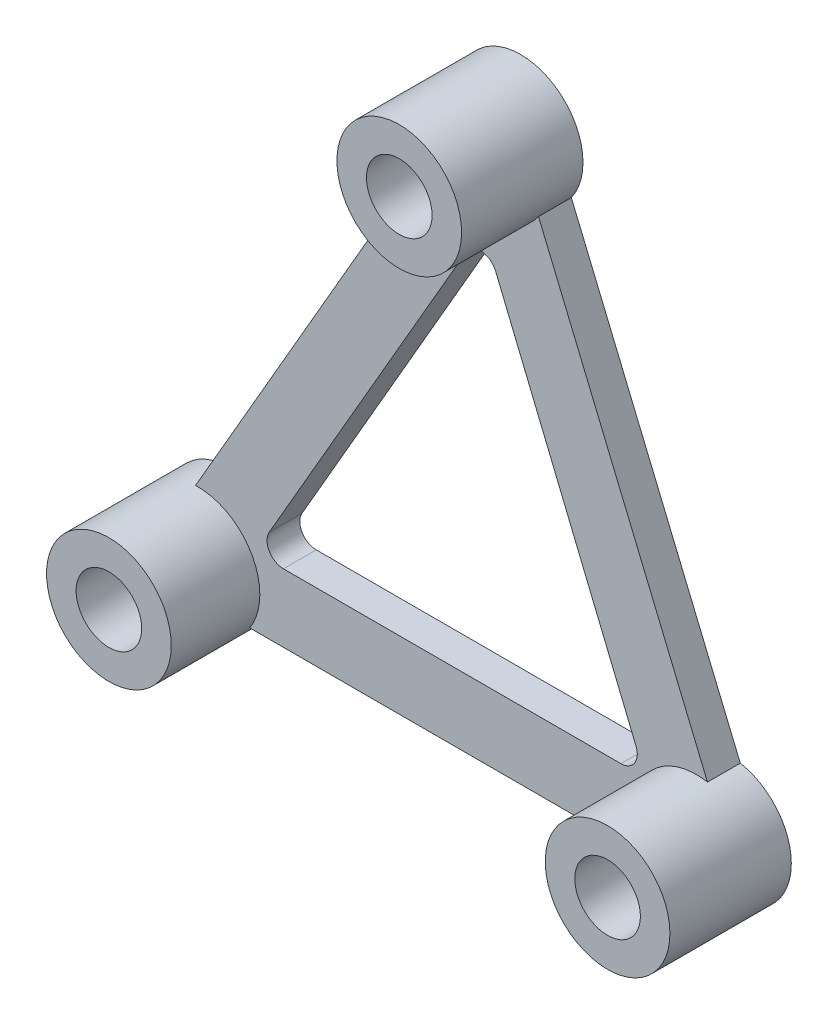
ISO-10303-21;
HEADER;
FILE_DESCRIPTION(('STEP AP214'),'2;1');
FILE_NAME('part.step','',(''),(''),'','','');
FILE_SCHEMA(('AUTOMOTIVE_DESIGN { 1 0 10303 214 1 1 1 1 }'));
ENDSEC;
DATA;
#1=APPLICATION_CONTEXT('core data for automotive mechanical design processes');
#2=APPLICATION_PROTOCOL_DEFINITION('international standard','automotive_design',2000,#1);
#3=PRODUCT_CONTEXT('',#1,'mechanical');
#4=PRODUCT('Part','Part','',(#3));
#5=PRODUCT_RELATED_PRODUCT_CATEGORY('part','',(#4));
#6=PRODUCT_DEFINITION_FORMATION('','',#4);
#7=PRODUCT_DEFINITION_CONTEXT('part definition',#1,'design');
#8=PRODUCT_DEFINITION('design','',#6,#7);
#9=PRODUCT_DEFINITION_SHAPE('','',#8);
#10=(LENGTH_UNIT() NAMED_UNIT(*) SI_UNIT(.MILLI.,.METRE.));
#11=(NAMED_UNIT(*) PLANE_ANGLE_UNIT() SI_UNIT($,.RADIAN.));
#12=(NAMED_UNIT(*) SI_UNIT($,.STERADIAN.) SOLID_ANGLE_UNIT());
#13=UNCERTAINTY_MEASURE_WITH_UNIT(LENGTH_MEASURE(1.E-05),#10,'distance_accuracy_value','');
#14=(GEOMETRIC_REPRESENTATION_CONTEXT(3) GLOBAL_UNCERTAINTY_ASSIGNED_CONTEXT((#13)) GLOBAL_UNIT_ASSIGNED_CONTEXT((#10,
#11,#12)) REPRESENTATION_CONTEXT('',''));
#15=CARTESIAN_POINT('',(0.,0.,0.));
#16=DIRECTION('',(0.,0.,1.));
#17=DIRECTION('',(1.,0.,0.));
#18=AXIS2_PLACEMENT_3D('',#15,#16,#17);
#19=CARTESIAN_POINT('',(17.6999999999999,30.6572992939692,2.));
#20=DIRECTION('',(0.,0.,1.));
#21=DIRECTION('',(1.,0.,0.));
#22=AXIS2_PLACEMENT_3D('',#19,#20,#21);
#23=PLANE('',#22);
#24=CARTESIAN_POINT('',(17.6999999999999,30.6572992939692,2.));
#25=DIRECTION('',(0.,0.,1.));
#26=DIRECTION('',(1.,0.,0.));
#27=AXIS2_PLACEMENT_3D('',#24,#25,#26);
#28=CIRCLE('',#27,3.79999999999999);
#29=CARTESIAN_POINT('',(14.3523997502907,28.8590855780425,2.));
#30=VERTEX_POINT('',#29);
#31=CARTESIAN_POINT('',(20.78925745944,28.4444982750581,2.));
#32=VERTEX_POINT('',#31);
#33=EDGE_CURVE('E50',#30,#32,#28,.T.);
#34=ORIENTED_EDGE('',*,*,#33,.F.);
#35=DIRECTION('',(-0.499999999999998,-0.86602540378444,0.));
#36=VECTOR('',#35,1.);
#37=CARTESIAN_POINT('',(15.967949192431,31.6572992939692,2.));
#38=LINE('',#37,#36);
#39=CARTESIAN_POINT('',(-0.11650136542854,3.79821371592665,2.));
#40=VERTEX_POINT('',#39);
#41=EDGE_CURVE('E199',#30,#40,#38,.T.);
#42=ORIENTED_EDGE('',*,*,#41,.T.);
#43=CARTESIAN_POINT('',(0.,0.,2.));
#44=DIRECTION('',(0.,0.,1.));
#45=DIRECTION('',(1.,0.,0.));
#46=AXIS2_PLACEMENT_3D('',#43,#44,#45);
#47=CIRCLE('',#46,3.8);
#48=CARTESIAN_POINT('',(3.18424228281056,-2.07378906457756,2.));
#49=VERTEX_POINT('',#48);
#50=EDGE_CURVE('E169',#49,#40,#47,.T.);
#51=ORIENTED_EDGE('',*,*,#50,.F.);
#52=DIRECTION('',(1.,0.,0.));
#53=VECTOR('',#52,1.);
#54=CARTESIAN_POINT('',(30.4,-2.07378906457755,2.));
#55=LINE('',#54,#53);
#56=CARTESIAN_POINT('',(27.2157577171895,-2.07378906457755,2.));
#57=VERTEX_POINT('',#56);
#58=EDGE_CURVE('E201',#49,#57,#55,.T.);
#59=ORIENTED_EDGE('',*,*,#58,.T.);
#60=CARTESIAN_POINT('',(30.4,0.,2.));
#61=DIRECTION('',(0.,0.,1.));
#62=DIRECTION('',(1.,0.,0.));
#63=AXIS2_PLACEMENT_3D('',#60,#61,#62);
#64=CIRCLE('',#63,3.79999999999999);
#65=CARTESIAN_POINT('',(31.0889279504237,3.73702800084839,2.));
#66=VERTEX_POINT('',#65);
#67=EDGE_CURVE('E147',#66,#57,#64,.T.);
#68=ORIENTED_EDGE('',*,*,#67,.F.);
#69=DIRECTION('',(-0.384771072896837,0.923012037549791,0.));
#70=VECTOR('',#69,1.);
#71=CARTESIAN_POINT('',(32.3141322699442,0.797934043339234,2.));
#72=LINE('',#71,#70);
#73=EDGE_CURVE('E140',#66,#32,#72,.T.);
#74=ORIENTED_EDGE('',*,*,#73,.T.);
#75=EDGE_LOOP('',(#34,#42,#51,#59,#68,#74));
#76=FACE_BOUND('',#75,.T.);
#77=DIRECTION('',(-0.380662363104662,0.924714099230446,0.));
#78=VECTOR('',#77,1.);
#79=CARTESIAN_POINT('',(27.3036889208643,2.07378906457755,2.));
#80=LINE('',#79,#78);
#81=CARTESIAN_POINT('',(26.7353335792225,3.45445142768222,2.));
#82=VERTEX_POINT('',#81);
#83=CARTESIAN_POINT('',(18.1726891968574,24.2550315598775,2.));
#84=VERTEX_POINT('',#83);
#85=EDGE_CURVE('E182',#82,#84,#80,.T.);
#86=ORIENTED_EDGE('',*,*,#85,.F.);
#87=CARTESIAN_POINT('',(25.810619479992,3.07378906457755,2.));
#88=DIRECTION('',(0.,0.,1.));
#89=DIRECTION('',(1.,0.,0.));
#90=AXIS2_PLACEMENT_3D('',#87,#88,#89);
#91=CIRCLE('',#90,1.);
#92=CARTESIAN_POINT('',(25.810619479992,2.07378906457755,2.));
#93=VERTEX_POINT('',#92);
#94=EDGE_CURVE('E224',#82,#93,#91,.F.);
#95=ORIENTED_EDGE('',*,*,#94,.T.);
#96=DIRECTION('',(1.,0.,0.));
#97=VECTOR('',#96,1.);
#98=CARTESIAN_POINT('',(27.3036889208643,2.07378906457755,2.));
#99=LINE('',#98,#97);
#100=CARTESIAN_POINT('',(5.23875455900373,2.07378906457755,2.));
#101=VERTEX_POINT('',#100);
#102=EDGE_CURVE('E179',#101,#93,#99,.T.);
#103=ORIENTED_EDGE('',*,*,#102,.F.);
#104=CARTESIAN_POINT('',(5.23875455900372,3.07378906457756,2.));
#105=DIRECTION('',(0.,0.,1.));
#106=DIRECTION('',(1.,0.,0.));
#107=AXIS2_PLACEMENT_3D('',#104,#105,#106);
#108=CIRCLE('',#107,1.);
#109=CARTESIAN_POINT('',(4.37272915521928,3.57378906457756,2.));
#110=VERTEX_POINT('',#109);
#111=EDGE_CURVE('E228',#101,#110,#108,.F.);
#112=ORIENTED_EDGE('',*,*,#111,.T.);
#113=DIRECTION('',(-0.499999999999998,-0.86602540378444,0.));
#114=VECTOR('',#113,1.);
#115=CARTESIAN_POINT('',(17.3986500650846,26.1353458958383,2.));
#116=LINE('',#115,#114);
#117=CARTESIAN_POINT('',(16.3819496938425,24.3743691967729,2.));
#118=VERTEX_POINT('',#117);
#119=EDGE_CURVE('E186',#118,#110,#116,.T.);
#120=ORIENTED_EDGE('',*,*,#119,.F.);
#121=CARTESIAN_POINT('',(17.247975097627,23.8743691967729,2.));
#122=DIRECTION('',(0.,0.,1.));
#123=DIRECTION('',(1.,0.,0.));
#124=AXIS2_PLACEMENT_3D('',#121,#122,#123);
#125=CIRCLE('',#124,1.);
#126=EDGE_CURVE('E232',#118,#84,#125,.F.);
#127=ORIENTED_EDGE('',*,*,#126,.T.);
#128=EDGE_LOOP('',(#86,#95,#103,#112,#120,#127));
#129=FACE_BOUND('',#128,.T.);
#130=ADVANCED_FACE('F35',(#76,#129),#23,.T.);
#131=CARTESIAN_POINT('',(17.6999999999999,30.6572992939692,0.));
#132=DIRECTION('',(0.,0.,1.));
#133=DIRECTION('',(1.,0.,0.));
#134=AXIS2_PLACEMENT_3D('',#131,#132,#133);
#135=PLANE('',#134);
#136=DIRECTION('',(-0.499999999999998,-0.86602540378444,0.));
#137=VECTOR('',#136,1.);
#138=CARTESIAN_POINT('',(15.967949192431,31.6572992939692,0.));
#139=LINE('',#138,#137);
#140=CARTESIAN_POINT('',(14.3523997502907,28.8590855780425,0.));
#141=VERTEX_POINT('',#140);
#142=CARTESIAN_POINT('',(-0.11650136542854,3.79821371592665,0.));
#143=VERTEX_POINT('',#142);
#144=EDGE_CURVE('E189',#141,#143,#139,.T.);
#145=ORIENTED_EDGE('',*,*,#144,.F.);
#146=CARTESIAN_POINT('',(17.6999999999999,30.6572992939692,0.));
#147=DIRECTION('',(0.,0.,1.));
#148=DIRECTION('',(1.,0.,0.));
#149=AXIS2_PLACEMENT_3D('',#146,#147,#148);
#150=CIRCLE('',#149,3.79999999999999);
#151=CARTESIAN_POINT('',(20.78925745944,28.4444982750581,0.));
#152=VERTEX_POINT('',#151);
#153=EDGE_CURVE('E131',#152,#141,#150,.T.);
#154=ORIENTED_EDGE('',*,*,#153,.F.);
#155=DIRECTION('',(-0.384771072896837,0.923012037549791,0.));
#156=VECTOR('',#155,1.);
#157=CARTESIAN_POINT('',(32.3141322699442,0.797934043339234,0.));
#158=LINE('',#157,#156);
#159=CARTESIAN_POINT('',(31.0889279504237,3.73702800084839,0.));
#160=VERTEX_POINT('',#159);
#161=EDGE_CURVE('E124',#160,#152,#158,.T.);
#162=ORIENTED_EDGE('',*,*,#161,.F.);
#163=CARTESIAN_POINT('',(30.4,0.,0.));
#164=DIRECTION('',(0.,0.,1.));
#165=DIRECTION('',(1.,0.,0.));
#166=AXIS2_PLACEMENT_3D('',#163,#164,#165);
#167=CIRCLE('',#166,3.79999999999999);
#168=CARTESIAN_POINT('',(27.2157577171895,-2.07378906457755,0.));
#169=VERTEX_POINT('',#168);
#170=EDGE_CURVE('E129',#169,#160,#167,.T.);
#171=ORIENTED_EDGE('',*,*,#170,.F.);
#172=DIRECTION('',(1.,0.,0.));
#173=VECTOR('',#172,1.);
#174=CARTESIAN_POINT('',(30.4,-2.07378906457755,0.));
#175=LINE('',#174,#173);
#176=CARTESIAN_POINT('',(3.18424228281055,-2.07378906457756,0.));
#177=VERTEX_POINT('',#176);
#178=EDGE_CURVE('E135',#177,#169,#175,.T.);
#179=ORIENTED_EDGE('',*,*,#178,.F.);
#180=CARTESIAN_POINT('',(0.,0.,0.));
#181=DIRECTION('',(0.,0.,1.));
#182=DIRECTION('',(1.,0.,0.));
#183=AXIS2_PLACEMENT_3D('',#180,#181,#182);
#184=CIRCLE('',#183,3.8);
#185=EDGE_CURVE('E166',#143,#177,#184,.T.);
#186=ORIENTED_EDGE('',*,*,#185,.F.);
#187=EDGE_LOOP('',(#145,#154,#162,#171,#179,#186));
#188=FACE_BOUND('',#187,.T.);
#189=DIRECTION('',(-0.499999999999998,-0.86602540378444,0.));
#190=VECTOR('',#189,1.);
#191=CARTESIAN_POINT('',(17.3986500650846,26.1353458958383,0.));
#192=LINE('',#191,#190);
#193=CARTESIAN_POINT('',(16.3819496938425,24.3743691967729,0.));
#194=VERTEX_POINT('',#193);
#195=CARTESIAN_POINT('',(4.37272915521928,3.57378906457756,0.));
#196=VERTEX_POINT('',#195);
#197=EDGE_CURVE('E183',#194,#196,#192,.T.);
#198=ORIENTED_EDGE('',*,*,#197,.T.);
#199=CARTESIAN_POINT('',(5.23875455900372,3.07378906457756,0.));
#200=DIRECTION('',(0.,0.,1.));
#201=DIRECTION('',(1.,0.,0.));
#202=AXIS2_PLACEMENT_3D('',#199,#200,#201);
#203=CIRCLE('',#202,1.);
#204=CARTESIAN_POINT('',(5.23875455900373,2.07378906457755,0.));
#205=VERTEX_POINT('',#204);
#206=EDGE_CURVE('E226',#196,#205,#203,.T.);
#207=ORIENTED_EDGE('',*,*,#206,.T.);
#208=DIRECTION('',(1.,0.,0.));
#209=VECTOR('',#208,1.);
#210=CARTESIAN_POINT('',(27.3036889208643,2.07378906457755,0.));
#211=LINE('',#210,#209);
#212=CARTESIAN_POINT('',(25.810619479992,2.07378906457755,0.));
#213=VERTEX_POINT('',#212);
#214=EDGE_CURVE('E178',#205,#213,#211,.T.);
#215=ORIENTED_EDGE('',*,*,#214,.T.);
#216=CARTESIAN_POINT('',(25.810619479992,3.07378906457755,0.));
#217=DIRECTION('',(0.,0.,1.));
#218=DIRECTION('',(1.,0.,0.));
#219=AXIS2_PLACEMENT_3D('',#216,#217,#218);
#220=CIRCLE('',#219,1.);
#221=CARTESIAN_POINT('',(26.7353335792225,3.45445142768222,0.));
#222=VERTEX_POINT('',#221);
#223=EDGE_CURVE('E222',#213,#222,#220,.T.);
#224=ORIENTED_EDGE('',*,*,#223,.T.);
#225=DIRECTION('',(-0.380662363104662,0.924714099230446,0.));
#226=VECTOR('',#225,1.);
#227=CARTESIAN_POINT('',(27.3036889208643,2.07378906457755,0.));
#228=LINE('',#227,#226);
#229=CARTESIAN_POINT('',(18.1726891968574,24.2550315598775,0.));
#230=VERTEX_POINT('',#229);
#231=EDGE_CURVE('E192',#222,#230,#228,.T.);
#232=ORIENTED_EDGE('',*,*,#231,.T.);
#233=CARTESIAN_POINT('',(17.247975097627,23.8743691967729,0.));
#234=DIRECTION('',(0.,0.,1.));
#235=DIRECTION('',(1.,0.,0.));
#236=AXIS2_PLACEMENT_3D('',#233,#234,#235);
#237=CIRCLE('',#236,1.);
#238=EDGE_CURVE('E230',#230,#194,#237,.T.);
#239=ORIENTED_EDGE('',*,*,#238,.T.);
#240=EDGE_LOOP('',(#198,#207,#215,#224,#232,#239));
#241=FACE_BOUND('',#240,.T.);
#242=ADVANCED_FACE('F126',(#188,#241),#135,.F.);
#243=CARTESIAN_POINT('',(15.967949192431,31.6572992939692,2.));
#244=DIRECTION('',(0.86602540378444,-0.499999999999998,0.));
#245=DIRECTION('',(0.499999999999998,0.86602540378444,0.));
#246=AXIS2_PLACEMENT_3D('',#243,#244,#245);
#247=PLANE('',#246);
#248=ORIENTED_EDGE('',*,*,#41,.F.);
#249=DIRECTION('',(0.,0.,1.));
#250=VECTOR('',#249,1.);
#251=CARTESIAN_POINT('',(14.3523997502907,28.8590855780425,0.));
#252=LINE('',#251,#250);
#253=EDGE_CURVE('E57',#30,#141,#252,.F.);
#254=ORIENTED_EDGE('',*,*,#253,.T.);
#255=ORIENTED_EDGE('',*,*,#144,.T.);
#256=DIRECTION('',(0.,0.,1.));
#257=VECTOR('',#256,1.);
#258=CARTESIAN_POINT('',(-0.116501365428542,3.79821371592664,0.));
#259=LINE('',#258,#257);
#260=EDGE_CURVE('E172',#143,#40,#259,.T.);
#261=ORIENTED_EDGE('',*,*,#260,.T.);
#262=EDGE_LOOP('',(#248,#254,#255,#261));
#263=FACE_BOUND('',#262,.T.);
#264=ADVANCED_FACE('F278',(#263),#247,.F.);
#265=CARTESIAN_POINT('',(30.4,-2.07378906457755,2.));
#266=DIRECTION('',(0.,1.,0.));
#267=DIRECTION('',(-1.,0.,0.));
#268=AXIS2_PLACEMENT_3D('',#265,#266,#267);
#269=PLANE('',#268);
#270=ORIENTED_EDGE('',*,*,#178,.T.);
#271=DIRECTION('',(0.,0.,1.));
#272=VECTOR('',#271,1.);
#273=CARTESIAN_POINT('',(27.2157577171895,-2.07378906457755,0.));
#274=LINE('',#273,#272);
#275=EDGE_CURVE('E146',#169,#57,#274,.T.);
#276=ORIENTED_EDGE('',*,*,#275,.T.);
#277=ORIENTED_EDGE('',*,*,#58,.F.);
#278=DIRECTION('',(0.,0.,1.));
#279=VECTOR('',#278,1.);
#280=CARTESIAN_POINT('',(3.18424228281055,-2.07378906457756,0.));
#281=LINE('',#280,#279);
#282=EDGE_CURVE('E143',#49,#177,#281,.F.);
#283=ORIENTED_EDGE('',*,*,#282,.T.);
#284=EDGE_LOOP('',(#270,#276,#277,#283));
#285=FACE_BOUND('',#284,.T.);
#286=ADVANCED_FACE('F238',(#285),#269,.F.);
#287=CARTESIAN_POINT('',(32.3141322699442,0.797934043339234,2.));
#288=DIRECTION('',(-0.923012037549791,-0.384771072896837,0.));
#289=DIRECTION('',(0.384771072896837,-0.923012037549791,0.));
#290=AXIS2_PLACEMENT_3D('',#287,#288,#289);
#291=PLANE('',#290);
#292=ORIENTED_EDGE('',*,*,#161,.T.);
#293=DIRECTION('',(0.,0.,1.));
#294=VECTOR('',#293,1.);
#295=CARTESIAN_POINT('',(20.78925745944,28.4444982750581,0.));
#296=LINE('',#295,#294);
#297=EDGE_CURVE('E11',#152,#32,#296,.T.);
#298=ORIENTED_EDGE('',*,*,#297,.T.);
#299=ORIENTED_EDGE('',*,*,#73,.F.);
#300=DIRECTION('',(0.,0.,1.));
#301=VECTOR('',#300,1.);
#302=CARTESIAN_POINT('',(31.0889279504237,3.73702800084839,0.));
#303=LINE('',#302,#301);
#304=EDGE_CURVE('E43',#66,#160,#303,.F.);
#305=ORIENTED_EDGE('',*,*,#304,.T.);
#306=EDGE_LOOP('',(#292,#298,#299,#305));
#307=FACE_BOUND('',#306,.T.);
#308=ADVANCED_FACE('F139',(#307),#291,.F.);
#309=CARTESIAN_POINT('',(27.3036889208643,2.07378906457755,2.));
#310=DIRECTION('',(0.,1.,0.));
#311=DIRECTION('',(-1.,0.,0.));
#312=AXIS2_PLACEMENT_3D('',#309,#310,#311);
#313=PLANE('',#312);
#314=ORIENTED_EDGE('',*,*,#102,.T.);
#315=DIRECTION('',(0.,0.,-1.));
#316=VECTOR('',#315,1.);
#317=CARTESIAN_POINT('',(25.810619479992,2.07378906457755,0.));
#318=LINE('',#317,#316);
#319=EDGE_CURVE('E209',#93,#213,#318,.T.);
#320=ORIENTED_EDGE('',*,*,#319,.T.);
#321=ORIENTED_EDGE('',*,*,#214,.F.);
#322=DIRECTION('',(0.,0.,-1.));
#323=VECTOR('',#322,1.);
#324=CARTESIAN_POINT('',(5.23875455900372,2.07378906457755,2.));
#325=LINE('',#324,#323);
#326=EDGE_CURVE('E205',#205,#101,#325,.F.);
#327=ORIENTED_EDGE('',*,*,#326,.T.);
#328=EDGE_LOOP('',(#314,#320,#321,#327));
#329=FACE_BOUND('',#328,.T.);
#330=ADVANCED_FACE('F317',(#329),#313,.T.);
#331=CARTESIAN_POINT('',(27.3036889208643,2.07378906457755,2.));
#332=DIRECTION('',(-0.924714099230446,-0.380662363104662,0.));
#333=DIRECTION('',(0.380662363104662,-0.924714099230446,0.));
#334=AXIS2_PLACEMENT_3D('',#331,#332,#333);
#335=PLANE('',#334);
#336=ORIENTED_EDGE('',*,*,#231,.F.);
#337=DIRECTION('',(0.,0.,-1.));
#338=VECTOR('',#337,1.);
#339=CARTESIAN_POINT('',(26.7353335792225,3.45445142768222,2.));
#340=LINE('',#339,#338);
#341=EDGE_CURVE('E215',#222,#82,#340,.F.);
#342=ORIENTED_EDGE('',*,*,#341,.T.);
#343=ORIENTED_EDGE('',*,*,#85,.T.);
#344=DIRECTION('',(0.,0.,-1.));
#345=VECTOR('',#344,1.);
#346=CARTESIAN_POINT('',(18.1726891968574,24.2550315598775,0.));
#347=LINE('',#346,#345);
#348=EDGE_CURVE('E212',#84,#230,#347,.T.);
#349=ORIENTED_EDGE('',*,*,#348,.T.);
#350=EDGE_LOOP('',(#336,#342,#343,#349));
#351=FACE_BOUND('',#350,.T.);
#352=ADVANCED_FACE('F314',(#351),#335,.T.);
#353=CARTESIAN_POINT('',(17.3986500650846,26.1353458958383,2.));
#354=DIRECTION('',(0.86602540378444,-0.499999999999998,0.));
#355=DIRECTION('',(0.499999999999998,0.86602540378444,0.));
#356=AXIS2_PLACEMENT_3D('',#353,#354,#355);
#357=PLANE('',#356);
#358=ORIENTED_EDGE('',*,*,#119,.T.);
#359=DIRECTION('',(0.,0.,-1.));
#360=VECTOR('',#359,1.);
#361=CARTESIAN_POINT('',(4.37272915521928,3.57378906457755,0.));
#362=LINE('',#361,#360);
#363=EDGE_CURVE('E219',#110,#196,#362,.T.);
#364=ORIENTED_EDGE('',*,*,#363,.T.);
#365=ORIENTED_EDGE('',*,*,#197,.F.);
#366=DIRECTION('',(0.,0.,-1.));
#367=VECTOR('',#366,1.);
#368=CARTESIAN_POINT('',(16.3819496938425,24.3743691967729,2.));
#369=LINE('',#368,#367);
#370=EDGE_CURVE('E217',#194,#118,#369,.F.);
#371=ORIENTED_EDGE('',*,*,#370,.T.);
#372=EDGE_LOOP('',(#358,#364,#365,#371));
#373=FACE_BOUND('',#372,.T.);
#374=ADVANCED_FACE('F310',(#373),#357,.T.);
#375=CARTESIAN_POINT('',(25.810619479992,3.07378906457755,2.));
#376=DIRECTION('',(0.,0.,1.));
#377=DIRECTION('',(1.,0.,0.));
#378=AXIS2_PLACEMENT_3D('',#375,#376,#377);
#379=CYLINDRICAL_SURFACE('',#378,1.);
#380=ORIENTED_EDGE('',*,*,#94,.F.);
#381=ORIENTED_EDGE('',*,*,#341,.F.);
#382=ORIENTED_EDGE('',*,*,#223,.F.);
#383=ORIENTED_EDGE('',*,*,#319,.F.);
#384=EDGE_LOOP('',(#380,#381,#382,#383));
#385=FACE_BOUND('',#384,.T.);
#386=ADVANCED_FACE('F313',(#385),#379,.F.);
#387=CARTESIAN_POINT('',(5.23875455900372,3.07378906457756,2.));
#388=DIRECTION('',(0.,0.,1.));
#389=DIRECTION('',(1.,0.,0.));
#390=AXIS2_PLACEMENT_3D('',#387,#388,#389);
#391=CYLINDRICAL_SURFACE('',#390,1.);
#392=ORIENTED_EDGE('',*,*,#111,.F.);
#393=ORIENTED_EDGE('',*,*,#326,.F.);
#394=ORIENTED_EDGE('',*,*,#206,.F.);
#395=ORIENTED_EDGE('',*,*,#363,.F.);
#396=EDGE_LOOP('',(#392,#393,#394,#395));
#397=FACE_BOUND('',#396,.T.);
#398=ADVANCED_FACE('F343',(#397),#391,.F.);
#399=CARTESIAN_POINT('',(17.247975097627,23.8743691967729,2.));
#400=DIRECTION('',(0.,0.,1.));
#401=DIRECTION('',(1.,0.,0.));
#402=AXIS2_PLACEMENT_3D('',#399,#400,#401);
#403=CYLINDRICAL_SURFACE('',#402,1.);
#404=ORIENTED_EDGE('',*,*,#126,.F.);
#405=ORIENTED_EDGE('',*,*,#370,.F.);
#406=ORIENTED_EDGE('',*,*,#238,.F.);
#407=ORIENTED_EDGE('',*,*,#348,.F.);
#408=EDGE_LOOP('',(#404,#405,#406,#407));
#409=FACE_BOUND('',#408,.T.);
#410=ADVANCED_FACE('F37',(#409),#403,.F.);
#411=CARTESIAN_POINT('',(0.,0.,0.));
#412=DIRECTION('',(0.,0.,1.));
#413=DIRECTION('',(1.,0.,0.));
#414=AXIS2_PLACEMENT_3D('',#411,#412,#413);
#415=CYLINDRICAL_SURFACE('',#414,3.8);
#416=CARTESIAN_POINT('',(0.,0.,7.4));
#417=DIRECTION('',(0.,0.,1.));
#418=DIRECTION('',(1.,0.,0.));
#419=AXIS2_PLACEMENT_3D('',#416,#417,#418);
#420=CIRCLE('',#419,3.8);
#421=CARTESIAN_POINT('',(3.8,0.,7.4));
#422=VERTEX_POINT('',#421);
#423=EDGE_CURVE('E163',#422,#422,#420,.T.);
#424=ORIENTED_EDGE('',*,*,#423,.F.);
#425=EDGE_LOOP('',(#424));
#426=FACE_BOUND('',#425,.T.);
#427=ORIENTED_EDGE('',*,*,#260,.F.);
#428=ORIENTED_EDGE('',*,*,#185,.T.);
#429=ORIENTED_EDGE('',*,*,#282,.F.);
#430=ORIENTED_EDGE('',*,*,#50,.T.);
#431=EDGE_LOOP('',(#427,#428,#429,#430));
#432=FACE_BOUND('',#431,.T.);
#433=ADVANCED_FACE('F242',(#426,#432),#415,.T.);
#434=CARTESIAN_POINT('',(0.,0.,0.));
#435=DIRECTION('',(0.,0.,1.));
#436=DIRECTION('',(1.,0.,0.));
#437=AXIS2_PLACEMENT_3D('',#434,#435,#436);
#438=CYLINDRICAL_SURFACE('',#437,2.);
#439=CARTESIAN_POINT('',(0.,0.,2.));
#440=DIRECTION('',(0.,0.,1.));
#441=DIRECTION('',(1.,0.,0.));
#442=AXIS2_PLACEMENT_3D('',#439,#440,#441);
#443=CIRCLE('',#442,2.);
#444=CARTESIAN_POINT('',(2.,0.,2.));
#445=VERTEX_POINT('',#444);
#446=EDGE_CURVE('E175',#445,#445,#443,.T.);
#447=ORIENTED_EDGE('',*,*,#446,.F.);
#448=EDGE_LOOP('',(#447));
#449=FACE_BOUND('',#448,.T.);
#450=CARTESIAN_POINT('',(0.,0.,7.4));
#451=DIRECTION('',(0.,0.,1.));
#452=DIRECTION('',(1.,0.,0.));
#453=AXIS2_PLACEMENT_3D('',#450,#451,#452);
#454=CIRCLE('',#453,2.);
#455=CARTESIAN_POINT('',(2.,0.,7.4));
#456=VERTEX_POINT('',#455);
#457=EDGE_CURVE('E160',#456,#456,#454,.T.);
#458=ORIENTED_EDGE('',*,*,#457,.T.);
#459=EDGE_LOOP('',(#458));
#460=FACE_BOUND('',#459,.T.);
#461=ADVANCED_FACE('F294',(#449,#460),#438,.F.);
#462=CARTESIAN_POINT('',(0.,0.,7.4));
#463=DIRECTION('',(0.,0.,1.));
#464=DIRECTION('',(1.,0.,0.));
#465=AXIS2_PLACEMENT_3D('',#462,#463,#464);
#466=PLANE('',#465);
#467=ORIENTED_EDGE('',*,*,#423,.T.);
#468=EDGE_LOOP('',(#467));
#469=FACE_BOUND('',#468,.T.);
#470=ORIENTED_EDGE('',*,*,#457,.F.);
#471=EDGE_LOOP('',(#470));
#472=FACE_BOUND('',#471,.T.);
#473=ADVANCED_FACE('F286',(#469,#472),#466,.T.);
#474=ORIENTED_EDGE('',*,*,#446,.T.);
#475=EDGE_LOOP('',(#474));
#476=FACE_BOUND('',#475,.T.);
#477=ADVANCED_FACE('F269',(#476),#23,.T.);
#478=CARTESIAN_POINT('',(30.4,0.,0.));
#479=DIRECTION('',(0.,0.,1.));
#480=DIRECTION('',(1.,0.,0.));
#481=AXIS2_PLACEMENT_3D('',#478,#479,#480);
#482=CYLINDRICAL_SURFACE('',#481,3.79999999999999);
#483=CARTESIAN_POINT('',(30.4,0.,7.4));
#484=DIRECTION('',(0.,0.,1.));
#485=DIRECTION('',(1.,0.,0.));
#486=AXIS2_PLACEMENT_3D('',#483,#484,#485);
#487=CIRCLE('',#486,3.79999999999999);
#488=CARTESIAN_POINT('',(34.2,0.,7.4));
#489=VERTEX_POINT('',#488);
#490=EDGE_CURVE('E148',#489,#489,#487,.T.);
#491=ORIENTED_EDGE('',*,*,#490,.F.);
#492=EDGE_LOOP('',(#491));
#493=FACE_BOUND('',#492,.T.);
#494=ORIENTED_EDGE('',*,*,#275,.F.);
#495=ORIENTED_EDGE('',*,*,#170,.T.);
#496=ORIENTED_EDGE('',*,*,#304,.F.);
#497=ORIENTED_EDGE('',*,*,#67,.T.);
#498=EDGE_LOOP('',(#494,#495,#496,#497));
#499=FACE_BOUND('',#498,.T.);
#500=ADVANCED_FACE('F145',(#493,#499),#482,.T.);
#501=CARTESIAN_POINT('',(30.4,0.,0.));
#502=DIRECTION('',(0.,0.,1.));
#503=DIRECTION('',(1.,0.,0.));
#504=AXIS2_PLACEMENT_3D('',#501,#502,#503);
#505=CYLINDRICAL_SURFACE('',#504,2.00000000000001);
#506=CARTESIAN_POINT('',(30.4,0.,2.));
#507=DIRECTION('',(0.,0.,1.));
#508=DIRECTION('',(1.,0.,0.));
#509=AXIS2_PLACEMENT_3D('',#506,#507,#508);
#510=CIRCLE('',#509,2.00000000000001);
#511=CARTESIAN_POINT('',(32.4,0.,2.));
#512=VERTEX_POINT('',#511);
#513=EDGE_CURVE('E157',#512,#512,#510,.T.);
#514=ORIENTED_EDGE('',*,*,#513,.F.);
#515=EDGE_LOOP('',(#514));
#516=FACE_BOUND('',#515,.T.);
#517=CARTESIAN_POINT('',(30.4,0.,7.4));
#518=DIRECTION('',(0.,0.,1.));
#519=DIRECTION('',(1.,0.,0.));
#520=AXIS2_PLACEMENT_3D('',#517,#518,#519);
#521=CIRCLE('',#520,2.00000000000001);
#522=CARTESIAN_POINT('',(32.4,0.,7.4));
#523=VERTEX_POINT('',#522);
#524=EDGE_CURVE('E152',#523,#523,#521,.T.);
#525=ORIENTED_EDGE('',*,*,#524,.T.);
#526=EDGE_LOOP('',(#525));
#527=FACE_BOUND('',#526,.T.);
#528=ADVANCED_FACE('F256',(#516,#527),#505,.F.);
#529=CARTESIAN_POINT('',(30.4,0.,7.4));
#530=DIRECTION('',(0.,0.,1.));
#531=DIRECTION('',(1.,0.,0.));
#532=AXIS2_PLACEMENT_3D('',#529,#530,#531);
#533=PLANE('',#532);
#534=ORIENTED_EDGE('',*,*,#490,.T.);
#535=EDGE_LOOP('',(#534));
#536=FACE_BOUND('',#535,.T.);
#537=ORIENTED_EDGE('',*,*,#524,.F.);
#538=EDGE_LOOP('',(#537));
#539=FACE_BOUND('',#538,.T.);
#540=ADVANCED_FACE('F258',(#536,#539),#533,.T.);
#541=ORIENTED_EDGE('',*,*,#513,.T.);
#542=EDGE_LOOP('',(#541));
#543=FACE_BOUND('',#542,.T.);
#544=ADVANCED_FACE('F260',(#543),#23,.T.);
#545=CARTESIAN_POINT('',(17.6999999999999,30.6572992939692,0.));
#546=DIRECTION('',(0.,0.,1.));
#547=DIRECTION('',(1.,0.,0.));
#548=AXIS2_PLACEMENT_3D('',#545,#546,#547);
#549=CYLINDRICAL_SURFACE('',#548,3.79999999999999);
#550=CARTESIAN_POINT('',(17.6999999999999,30.6572992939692,7.4));
#551=DIRECTION('',(0.,0.,1.));
#552=DIRECTION('',(1.,0.,0.));
#553=AXIS2_PLACEMENT_3D('',#550,#551,#552);
#554=CIRCLE('',#553,3.79999999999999);
#555=CARTESIAN_POINT('',(21.4999999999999,30.6572992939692,7.4));
#556=VERTEX_POINT('',#555);
#557=EDGE_CURVE('E245',#556,#556,#554,.T.);
#558=ORIENTED_EDGE('',*,*,#557,.F.);
#559=EDGE_LOOP('',(#558));
#560=FACE_BOUND('',#559,.T.);
#561=ORIENTED_EDGE('',*,*,#253,.F.);
#562=ORIENTED_EDGE('',*,*,#33,.T.);
#563=ORIENTED_EDGE('',*,*,#297,.F.);
#564=ORIENTED_EDGE('',*,*,#153,.T.);
#565=EDGE_LOOP('',(#561,#562,#563,#564));
#566=FACE_BOUND('',#565,.T.);
#567=ADVANCED_FACE('F244',(#560,#566),#549,.T.);
#568=CARTESIAN_POINT('',(17.6999999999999,30.6572992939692,0.));
#569=DIRECTION('',(0.,0.,1.));
#570=DIRECTION('',(1.,0.,0.));
#571=AXIS2_PLACEMENT_3D('',#568,#569,#570);
#572=CYLINDRICAL_SURFACE('',#571,2.00000000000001);
#573=CARTESIAN_POINT('',(17.6999999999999,30.6572992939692,2.));
#574=DIRECTION('',(0.,0.,1.));
#575=DIRECTION('',(1.,0.,0.));
#576=AXIS2_PLACEMENT_3D('',#573,#574,#575);
#577=CIRCLE('',#576,2.);
#578=CARTESIAN_POINT('',(19.6999999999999,30.6572992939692,2.));
#579=VERTEX_POINT('',#578);
#580=EDGE_CURVE('E134',#579,#579,#577,.T.);
#581=ORIENTED_EDGE('',*,*,#580,.F.);
#582=EDGE_LOOP('',(#581));
#583=FACE_BOUND('',#582,.T.);
#584=CARTESIAN_POINT('',(17.6999999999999,30.6572992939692,7.4));
#585=DIRECTION('',(0.,0.,1.));
#586=DIRECTION('',(1.,0.,0.));
#587=AXIS2_PLACEMENT_3D('',#584,#585,#586);
#588=CIRCLE('',#587,2.00000000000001);
#589=CARTESIAN_POINT('',(19.6999999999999,30.6572992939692,7.4));
#590=VERTEX_POINT('',#589);
#591=EDGE_CURVE('E249',#590,#590,#588,.T.);
#592=ORIENTED_EDGE('',*,*,#591,.T.);
#593=EDGE_LOOP('',(#592));
#594=FACE_BOUND('',#593,.T.);
#595=ADVANCED_FACE('F417',(#583,#594),#572,.F.);
#596=CARTESIAN_POINT('',(17.6999999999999,30.6572992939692,7.4));
#597=DIRECTION('',(0.,0.,1.));
#598=DIRECTION('',(1.,0.,0.));
#599=AXIS2_PLACEMENT_3D('',#596,#597,#598);
#600=PLANE('',#599);
#601=ORIENTED_EDGE('',*,*,#557,.T.);
#602=EDGE_LOOP('',(#601));
#603=FACE_BOUND('',#602,.T.);
#604=ORIENTED_EDGE('',*,*,#591,.F.);
#605=EDGE_LOOP('',(#604));
#606=FACE_BOUND('',#605,.T.);
#607=ADVANCED_FACE('F283',(#603,#606),#600,.T.);
#608=ORIENTED_EDGE('',*,*,#580,.T.);
#609=EDGE_LOOP('',(#608));
#610=FACE_BOUND('',#609,.T.);
#611=ADVANCED_FACE('F270',(#610),#23,.T.);
#612=CLOSED_SHELL('',(#130,#242,#264,#286,#308,#330,#352,#374,#386,#398,#410,#433,#461,#473,
#477,#500,#528,#540,#544,#567,#595,#607,#611));
#613=MANIFOLD_SOLID_BREP('B2',#612);
#614=ADVANCED_BREP_SHAPE_REPRESENTATION('',(#18,#613),#14);
#615=SHAPE_DEFINITION_REPRESENTATION(#9,#614);
ENDSEC;
END-ISO-10303-21;
